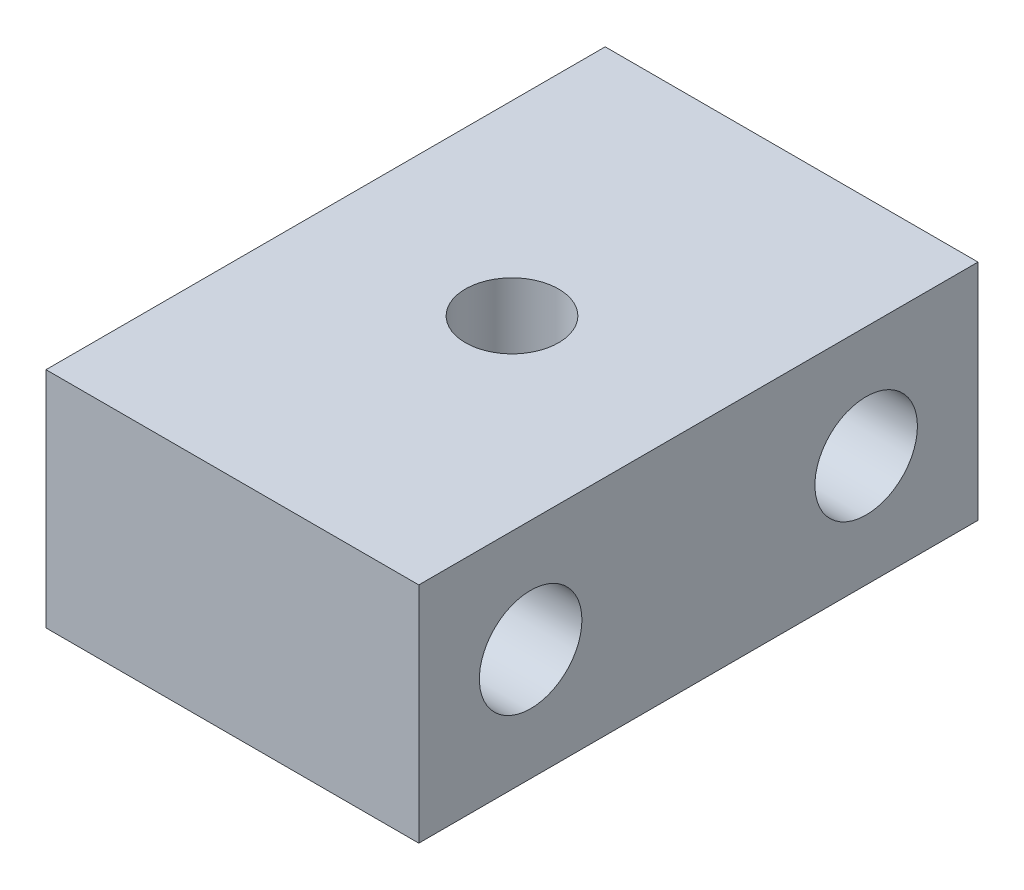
ISO-10303-21;
HEADER;
FILE_DESCRIPTION(('STEP AP214'),'2;1');
FILE_NAME('part.step','',(''),(''),'','','');
FILE_SCHEMA(('AUTOMOTIVE_DESIGN { 1 0 10303 214 1 1 1 1 }'));
ENDSEC;
DATA;
#1=APPLICATION_CONTEXT('core data for automotive mechanical design processes');
#2=APPLICATION_PROTOCOL_DEFINITION('international standard','automotive_design',2000,#1);
#3=PRODUCT_CONTEXT('',#1,'mechanical');
#4=PRODUCT('Part','Part','',(#3));
#5=PRODUCT_RELATED_PRODUCT_CATEGORY('part','',(#4));
#6=PRODUCT_DEFINITION_FORMATION('','',#4);
#7=PRODUCT_DEFINITION_CONTEXT('part definition',#1,'design');
#8=PRODUCT_DEFINITION('design','',#6,#7);
#9=PRODUCT_DEFINITION_SHAPE('','',#8);
#10=(LENGTH_UNIT() NAMED_UNIT(*) SI_UNIT(.MILLI.,.METRE.));
#11=(NAMED_UNIT(*) PLANE_ANGLE_UNIT() SI_UNIT($,.RADIAN.));
#12=(NAMED_UNIT(*) SI_UNIT($,.STERADIAN.) SOLID_ANGLE_UNIT());
#13=UNCERTAINTY_MEASURE_WITH_UNIT(LENGTH_MEASURE(1.E-05),#10,'distance_accuracy_value','');
#14=(GEOMETRIC_REPRESENTATION_CONTEXT(3) GLOBAL_UNCERTAINTY_ASSIGNED_CONTEXT((#13)) GLOBAL_UNIT_ASSIGNED_CONTEXT((#10,
#11,#12)) REPRESENTATION_CONTEXT('',''));
#15=CARTESIAN_POINT('',(0.,0.,0.));
#16=DIRECTION('',(0.,0.,1.));
#17=DIRECTION('',(1.,0.,0.));
#18=AXIS2_PLACEMENT_3D('',#15,#16,#17);
#19=CARTESIAN_POINT('',(-10.,6.,24.));
#20=DIRECTION('',(1.,0.,0.));
#21=DIRECTION('',(0.,0.,-1.));
#22=AXIS2_PLACEMENT_3D('',#19,#20,#21);
#23=CYLINDRICAL_SURFACE('',#22,2.75);
#24=CARTESIAN_POINT('',(20.,6.,24.));
#25=DIRECTION('',(1.,0.,0.));
#26=DIRECTION('',(0.,0.,-1.));
#27=AXIS2_PLACEMENT_3D('',#24,#25,#26);
#28=CIRCLE('',#27,2.75);
#29=CARTESIAN_POINT('',(20.,6.,21.25));
#30=VERTEX_POINT('',#29);
#31=EDGE_CURVE('E102',#30,#30,#28,.T.);
#32=ORIENTED_EDGE('',*,*,#31,.T.);
#33=EDGE_LOOP('',(#32));
#34=FACE_BOUND('',#33,.T.);
#35=CARTESIAN_POINT('',(5.5,6.,24.));
#36=DIRECTION('',(-1.,0.,0.));
#37=DIRECTION('',(0.,0.,1.));
#38=AXIS2_PLACEMENT_3D('',#35,#36,#37);
#39=CIRCLE('',#38,2.75);
#40=CARTESIAN_POINT('',(5.5,6.,26.75));
#41=VERTEX_POINT('',#40);
#42=EDGE_CURVE('E36',#41,#41,#39,.F.);
#43=ORIENTED_EDGE('',*,*,#42,.F.);
#44=EDGE_LOOP('',(#43));
#45=FACE_BOUND('',#44,.T.);
#46=ADVANCED_FACE('F32',(#34,#45),#23,.F.);
#47=CARTESIAN_POINT('',(-10.,6.,6.));
#48=DIRECTION('',(1.,0.,0.));
#49=DIRECTION('',(0.,0.,-1.));
#50=AXIS2_PLACEMENT_3D('',#47,#48,#49);
#51=CYLINDRICAL_SURFACE('',#50,2.75);
#52=CARTESIAN_POINT('',(20.,6.,6.));
#53=DIRECTION('',(1.,0.,0.));
#54=DIRECTION('',(0.,0.,-1.));
#55=AXIS2_PLACEMENT_3D('',#52,#53,#54);
#56=CIRCLE('',#55,2.75);
#57=CARTESIAN_POINT('',(20.,6.,3.25));
#58=VERTEX_POINT('',#57);
#59=EDGE_CURVE('E109',#58,#58,#56,.T.);
#60=ORIENTED_EDGE('',*,*,#59,.T.);
#61=EDGE_LOOP('',(#60));
#62=FACE_BOUND('',#61,.T.);
#63=CARTESIAN_POINT('',(5.5,6.,6.));
#64=DIRECTION('',(-1.,0.,0.));
#65=DIRECTION('',(0.,0.,1.));
#66=AXIS2_PLACEMENT_3D('',#63,#64,#65);
#67=CIRCLE('',#66,2.75);
#68=CARTESIAN_POINT('',(5.5,6.,8.75));
#69=VERTEX_POINT('',#68);
#70=EDGE_CURVE('E107',#69,#69,#67,.F.);
#71=ORIENTED_EDGE('',*,*,#70,.F.);
#72=EDGE_LOOP('',(#71));
#73=FACE_BOUND('',#72,.T.);
#74=ADVANCED_FACE('F144',(#62,#73),#51,.F.);
#75=CARTESIAN_POINT('',(0.,0.,30.));
#76=DIRECTION('',(1.,0.,0.));
#77=DIRECTION('',(0.,0.,-1.));
#78=AXIS2_PLACEMENT_3D('',#75,#76,#77);
#79=PLANE('',#78);
#80=CARTESIAN_POINT('',(0.,6.,24.));
#81=DIRECTION('',(-1.,0.,0.));
#82=DIRECTION('',(0.,0.,1.));
#83=AXIS2_PLACEMENT_3D('',#80,#81,#82);
#84=CIRCLE('',#83,4.75);
#85=CARTESIAN_POINT('',(0.,6.,28.75));
#86=VERTEX_POINT('',#85);
#87=EDGE_CURVE('E123',#86,#86,#84,.T.);
#88=ORIENTED_EDGE('',*,*,#87,.F.);
#89=EDGE_LOOP('',(#88));
#90=FACE_BOUND('',#89,.T.);
#91=CARTESIAN_POINT('',(0.,6.,6.));
#92=DIRECTION('',(-1.,0.,0.));
#93=DIRECTION('',(0.,0.,1.));
#94=AXIS2_PLACEMENT_3D('',#91,#92,#93);
#95=CIRCLE('',#94,4.75);
#96=CARTESIAN_POINT('',(0.,6.,10.75));
#97=VERTEX_POINT('',#96);
#98=EDGE_CURVE('E116',#97,#97,#95,.T.);
#99=ORIENTED_EDGE('',*,*,#98,.F.);
#100=EDGE_LOOP('',(#99));
#101=FACE_BOUND('',#100,.T.);
#102=DIRECTION('',(0.,-1.,0.));
#103=VECTOR('',#102,1.);
#104=CARTESIAN_POINT('',(0.,0.,0.));
#105=LINE('',#104,#103);
#106=CARTESIAN_POINT('',(0.,12.,0.));
#107=VERTEX_POINT('',#106);
#108=CARTESIAN_POINT('',(0.,0.,0.));
#109=VERTEX_POINT('',#108);
#110=EDGE_CURVE('E99',#107,#109,#105,.T.);
#111=ORIENTED_EDGE('',*,*,#110,.T.);
#112=DIRECTION('',(0.,0.,-1.));
#113=VECTOR('',#112,1.);
#114=CARTESIAN_POINT('',(0.,0.,30.));
#115=LINE('',#114,#113);
#116=CARTESIAN_POINT('',(0.,0.,30.));
#117=VERTEX_POINT('',#116);
#118=EDGE_CURVE('E11',#117,#109,#115,.T.);
#119=ORIENTED_EDGE('',*,*,#118,.F.);
#120=DIRECTION('',(0.,-1.,0.));
#121=VECTOR('',#120,1.);
#122=CARTESIAN_POINT('',(0.,0.,30.));
#123=LINE('',#122,#121);
#124=CARTESIAN_POINT('',(0.,12.,30.));
#125=VERTEX_POINT('',#124);
#126=EDGE_CURVE('E86',#125,#117,#123,.T.);
#127=ORIENTED_EDGE('',*,*,#126,.F.);
#128=DIRECTION('',(0.,0.,-1.));
#129=VECTOR('',#128,1.);
#130=CARTESIAN_POINT('',(0.,12.,30.));
#131=LINE('',#130,#129);
#132=EDGE_CURVE('E95',#125,#107,#131,.T.);
#133=ORIENTED_EDGE('',*,*,#132,.T.);
#134=EDGE_LOOP('',(#111,#119,#127,#133));
#135=FACE_BOUND('',#134,.T.);
#136=ADVANCED_FACE('F34',(#90,#101,#135),#79,.F.);
#137=CARTESIAN_POINT('',(0.,0.,30.));
#138=DIRECTION('',(0.,1.,0.));
#139=DIRECTION('',(0.,0.,1.));
#140=AXIS2_PLACEMENT_3D('',#137,#138,#139);
#141=PLANE('',#140);
#142=CARTESIAN_POINT('',(10.,0.,15.));
#143=DIRECTION('',(0.,1.,0.));
#144=DIRECTION('',(0.,0.,1.));
#145=AXIS2_PLACEMENT_3D('',#142,#143,#144);
#146=CIRCLE('',#145,2.5);
#147=CARTESIAN_POINT('',(10.,0.,17.5));
#148=VERTEX_POINT('',#147);
#149=EDGE_CURVE('E196',#148,#148,#146,.T.);
#150=ORIENTED_EDGE('',*,*,#149,.T.);
#151=EDGE_LOOP('',(#150));
#152=FACE_BOUND('',#151,.T.);
#153=DIRECTION('',(1.,0.,0.));
#154=VECTOR('',#153,1.);
#155=CARTESIAN_POINT('',(0.,0.,0.));
#156=LINE('',#155,#154);
#157=CARTESIAN_POINT('',(20.,0.,0.));
#158=VERTEX_POINT('',#157);
#159=EDGE_CURVE('E90',#109,#158,#156,.T.);
#160=ORIENTED_EDGE('',*,*,#159,.T.);
#161=DIRECTION('',(0.,0.,-1.));
#162=VECTOR('',#161,1.);
#163=CARTESIAN_POINT('',(20.,0.,30.));
#164=LINE('',#163,#162);
#165=CARTESIAN_POINT('',(20.,0.,30.));
#166=VERTEX_POINT('',#165);
#167=EDGE_CURVE('E42',#166,#158,#164,.T.);
#168=ORIENTED_EDGE('',*,*,#167,.F.);
#169=DIRECTION('',(1.,0.,0.));
#170=VECTOR('',#169,1.);
#171=CARTESIAN_POINT('',(0.,0.,30.));
#172=LINE('',#171,#170);
#173=EDGE_CURVE('E81',#117,#166,#172,.T.);
#174=ORIENTED_EDGE('',*,*,#173,.F.);
#175=ORIENTED_EDGE('',*,*,#118,.T.);
#176=EDGE_LOOP('',(#160,#168,#174,#175));
#177=FACE_BOUND('',#176,.T.);
#178=ADVANCED_FACE('F89',(#152,#177),#141,.F.);
#179=CARTESIAN_POINT('',(20.,0.,30.));
#180=DIRECTION('',(-1.,0.,0.));
#181=DIRECTION('',(0.,0.,1.));
#182=AXIS2_PLACEMENT_3D('',#179,#180,#181);
#183=PLANE('',#182);
#184=ORIENTED_EDGE('',*,*,#59,.F.);
#185=EDGE_LOOP('',(#184));
#186=FACE_BOUND('',#185,.T.);
#187=ORIENTED_EDGE('',*,*,#31,.F.);
#188=EDGE_LOOP('',(#187));
#189=FACE_BOUND('',#188,.T.);
#190=DIRECTION('',(0.,1.,0.));
#191=VECTOR('',#190,1.);
#192=CARTESIAN_POINT('',(20.,0.,0.));
#193=LINE('',#192,#191);
#194=CARTESIAN_POINT('',(20.,12.,0.));
#195=VERTEX_POINT('',#194);
#196=EDGE_CURVE('E68',#158,#195,#193,.T.);
#197=ORIENTED_EDGE('',*,*,#196,.T.);
#198=DIRECTION('',(0.,0.,-1.));
#199=VECTOR('',#198,1.);
#200=CARTESIAN_POINT('',(20.,12.,30.));
#201=LINE('',#200,#199);
#202=CARTESIAN_POINT('',(20.,12.,30.));
#203=VERTEX_POINT('',#202);
#204=EDGE_CURVE('E91',#203,#195,#201,.T.);
#205=ORIENTED_EDGE('',*,*,#204,.F.);
#206=DIRECTION('',(0.,1.,0.));
#207=VECTOR('',#206,1.);
#208=CARTESIAN_POINT('',(20.,0.,30.));
#209=LINE('',#208,#207);
#210=EDGE_CURVE('E84',#166,#203,#209,.T.);
#211=ORIENTED_EDGE('',*,*,#210,.F.);
#212=ORIENTED_EDGE('',*,*,#167,.T.);
#213=EDGE_LOOP('',(#197,#205,#211,#212));
#214=FACE_BOUND('',#213,.T.);
#215=ADVANCED_FACE('F93',(#186,#189,#214),#183,.F.);
#216=CARTESIAN_POINT('',(0.,12.,30.));
#217=DIRECTION('',(0.,-1.,0.));
#218=DIRECTION('',(0.,0.,-1.));
#219=AXIS2_PLACEMENT_3D('',#216,#217,#218);
#220=PLANE('',#219);
#221=CARTESIAN_POINT('',(10.,12.,15.));
#222=DIRECTION('',(0.,1.,0.));
#223=DIRECTION('',(0.,0.,1.));
#224=AXIS2_PLACEMENT_3D('',#221,#222,#223);
#225=CIRCLE('',#224,2.5);
#226=CARTESIAN_POINT('',(10.,12.,17.5));
#227=VERTEX_POINT('',#226);
#228=EDGE_CURVE('E199',#227,#227,#225,.T.);
#229=ORIENTED_EDGE('',*,*,#228,.F.);
#230=EDGE_LOOP('',(#229));
#231=FACE_BOUND('',#230,.T.);
#232=DIRECTION('',(-1.,0.,0.));
#233=VECTOR('',#232,1.);
#234=CARTESIAN_POINT('',(0.,12.,0.));
#235=LINE('',#234,#233);
#236=EDGE_CURVE('E74',#195,#107,#235,.T.);
#237=ORIENTED_EDGE('',*,*,#236,.T.);
#238=ORIENTED_EDGE('',*,*,#132,.F.);
#239=DIRECTION('',(-1.,0.,0.));
#240=VECTOR('',#239,1.);
#241=CARTESIAN_POINT('',(0.,12.,30.));
#242=LINE('',#241,#240);
#243=EDGE_CURVE('E51',#203,#125,#242,.T.);
#244=ORIENTED_EDGE('',*,*,#243,.F.);
#245=ORIENTED_EDGE('',*,*,#204,.T.);
#246=EDGE_LOOP('',(#237,#238,#244,#245));
#247=FACE_BOUND('',#246,.T.);
#248=ADVANCED_FACE('F132',(#231,#247),#220,.F.);
#249=CARTESIAN_POINT('',(0.,12.,30.));
#250=DIRECTION('',(0.,0.,-1.));
#251=DIRECTION('',(-1.,0.,0.));
#252=AXIS2_PLACEMENT_3D('',#249,#250,#251);
#253=PLANE('',#252);
#254=ORIENTED_EDGE('',*,*,#126,.T.);
#255=ORIENTED_EDGE('',*,*,#173,.T.);
#256=ORIENTED_EDGE('',*,*,#210,.T.);
#257=ORIENTED_EDGE('',*,*,#243,.T.);
#258=EDGE_LOOP('',(#254,#255,#256,#257));
#259=FACE_BOUND('',#258,.T.);
#260=ADVANCED_FACE('F82',(#259),#253,.F.);
#261=CARTESIAN_POINT('',(0.,12.,0.));
#262=DIRECTION('',(0.,0.,-1.));
#263=DIRECTION('',(-1.,0.,0.));
#264=AXIS2_PLACEMENT_3D('',#261,#262,#263);
#265=PLANE('',#264);
#266=ORIENTED_EDGE('',*,*,#110,.F.);
#267=ORIENTED_EDGE('',*,*,#236,.F.);
#268=ORIENTED_EDGE('',*,*,#196,.F.);
#269=ORIENTED_EDGE('',*,*,#159,.F.);
#270=EDGE_LOOP('',(#266,#267,#268,#269));
#271=FACE_BOUND('',#270,.T.);
#272=ADVANCED_FACE('F155',(#271),#265,.T.);
#273=CARTESIAN_POINT('',(5.5,6.,6.));
#274=DIRECTION('',(-1.,0.,0.));
#275=DIRECTION('',(0.,0.,1.));
#276=AXIS2_PLACEMENT_3D('',#273,#274,#275);
#277=PLANE('',#276);
#278=CARTESIAN_POINT('',(5.5,6.,6.));
#279=DIRECTION('',(-1.,0.,0.));
#280=DIRECTION('',(0.,0.,1.));
#281=AXIS2_PLACEMENT_3D('',#278,#279,#280);
#282=CIRCLE('',#281,4.75);
#283=CARTESIAN_POINT('',(5.5,6.,10.75));
#284=VERTEX_POINT('',#283);
#285=EDGE_CURVE('E110',#284,#284,#282,.T.);
#286=ORIENTED_EDGE('',*,*,#285,.T.);
#287=EDGE_LOOP('',(#286));
#288=FACE_BOUND('',#287,.T.);
#289=ORIENTED_EDGE('',*,*,#70,.T.);
#290=EDGE_LOOP('',(#289));
#291=FACE_BOUND('',#290,.T.);
#292=ADVANCED_FACE('F157',(#288,#291),#277,.T.);
#293=CARTESIAN_POINT('',(5.5,6.,6.));
#294=DIRECTION('',(-1.,0.,0.));
#295=DIRECTION('',(0.,0.,1.));
#296=AXIS2_PLACEMENT_3D('',#293,#294,#295);
#297=CYLINDRICAL_SURFACE('',#296,4.75);
#298=ORIENTED_EDGE('',*,*,#285,.F.);
#299=EDGE_LOOP('',(#298));
#300=FACE_BOUND('',#299,.T.);
#301=ORIENTED_EDGE('',*,*,#98,.T.);
#302=EDGE_LOOP('',(#301));
#303=FACE_BOUND('',#302,.T.);
#304=ADVANCED_FACE('F162',(#300,#303),#297,.F.);
#305=CARTESIAN_POINT('',(5.5,6.,24.));
#306=DIRECTION('',(-1.,0.,0.));
#307=DIRECTION('',(0.,0.,1.));
#308=AXIS2_PLACEMENT_3D('',#305,#306,#307);
#309=PLANE('',#308);
#310=CARTESIAN_POINT('',(5.5,6.,24.));
#311=DIRECTION('',(-1.,0.,0.));
#312=DIRECTION('',(0.,0.,1.));
#313=AXIS2_PLACEMENT_3D('',#310,#311,#312);
#314=CIRCLE('',#313,4.75);
#315=CARTESIAN_POINT('',(5.5,6.,28.75));
#316=VERTEX_POINT('',#315);
#317=EDGE_CURVE('E202',#316,#316,#314,.T.);
#318=ORIENTED_EDGE('',*,*,#317,.T.);
#319=EDGE_LOOP('',(#318));
#320=FACE_BOUND('',#319,.T.);
#321=ORIENTED_EDGE('',*,*,#42,.T.);
#322=EDGE_LOOP('',(#321));
#323=FACE_BOUND('',#322,.T.);
#324=ADVANCED_FACE('F176',(#320,#323),#309,.T.);
#325=CARTESIAN_POINT('',(5.5,6.,24.));
#326=DIRECTION('',(-1.,0.,0.));
#327=DIRECTION('',(0.,0.,1.));
#328=AXIS2_PLACEMENT_3D('',#325,#326,#327);
#329=CYLINDRICAL_SURFACE('',#328,4.75);
#330=ORIENTED_EDGE('',*,*,#317,.F.);
#331=EDGE_LOOP('',(#330));
#332=FACE_BOUND('',#331,.T.);
#333=ORIENTED_EDGE('',*,*,#87,.T.);
#334=EDGE_LOOP('',(#333));
#335=FACE_BOUND('',#334,.T.);
#336=ADVANCED_FACE('F181',(#332,#335),#329,.F.);
#337=CARTESIAN_POINT('',(10.,0.,15.));
#338=DIRECTION('',(0.,1.,0.));
#339=DIRECTION('',(0.,0.,1.));
#340=AXIS2_PLACEMENT_3D('',#337,#338,#339);
#341=CYLINDRICAL_SURFACE('',#340,2.5);
#342=ORIENTED_EDGE('',*,*,#149,.F.);
#343=EDGE_LOOP('',(#342));
#344=FACE_BOUND('',#343,.T.);
#345=ORIENTED_EDGE('',*,*,#228,.T.);
#346=EDGE_LOOP('',(#345));
#347=FACE_BOUND('',#346,.T.);
#348=ADVANCED_FACE('F186',(#344,#347),#341,.F.);
#349=CLOSED_SHELL('',(#46,#74,#136,#178,#215,#248,#260,#272,#292,#304,#324,#336,#348));
#350=MANIFOLD_SOLID_BREP('B2',#349);
#351=ADVANCED_BREP_SHAPE_REPRESENTATION('',(#18,#350),#14);
#352=SHAPE_DEFINITION_REPRESENTATION(#9,#351);
ENDSEC;
END-ISO-10303-21;
